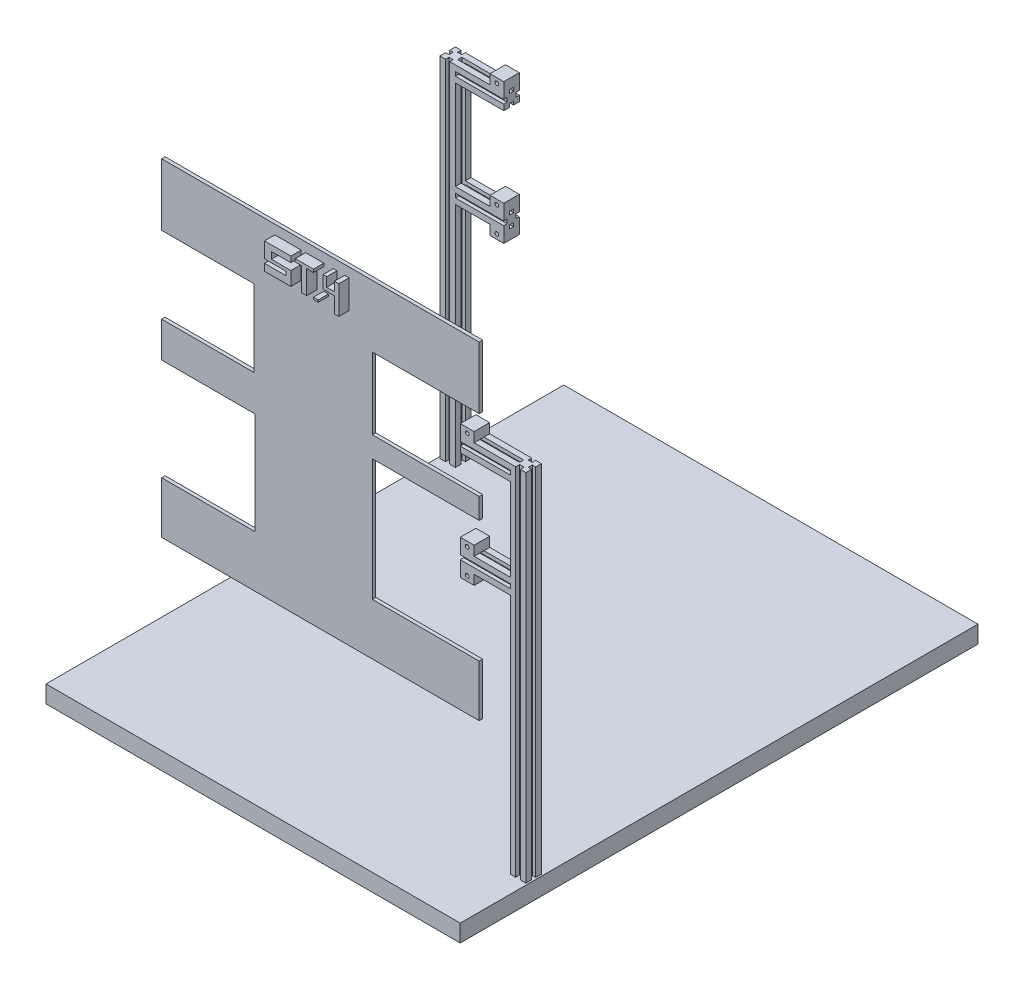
from build123d import *

# Parameters (mm, degrees)
SCHIZZO1_W                    = 1200
SCHIZZO1_H                    = 1500
ESTRUSIONE_ESTRUSIONE1_DEPTH  = 50
ESTRUSIONE_ESTRUSIONE2_DEPTH  = 705
ESTRUSIONE_ESTRUSIONE3_DEPTH  = 140
ESTRUSIONE_ESTRUSIONE4_DEPTH  = 305
ESTRUSIONE_ESTRUSIONE5_DEPTH  = 745
ESTRUSIONE_ESTRUSIONE6_DEPTH  = 145
ESTRUSIONE_ESTRUSIONE7_DEPTH  = 285
SCHIZZO7_W                    = 40
SCHIZZO7_H                    = 45
ESTRUSIONE_ESTRUSIONE8_DEPTH  = 28
SCHIZZO8_R                    = 5.5
TAGLIO_ESTRUSIONE1_DEPTH      = 45
SCHIZZO9_W                    = 40
SCHIZZO9_H                    = 45
ESTRUSIONE_ESTRUSIONE9_DEPTH  = 28
SCHIZZO10_R                   = 5.5
TAGLIO_ESTRUSIONE2_DEPTH      = 45
SCHIZZO11_W                   = 40
SCHIZZO11_H                   = 45
ESTRUSIONE_ESTRUSIONE10_DEPTH = 28
SCHIZZO12_R                   = 5.5
TAGLIO_ESTRUSIONE3_DEPTH      = 45
SCHIZZO13_W                   = 40
SCHIZZO13_H                   = 45
ESTRUSIONE_ESTRUSIONE11_DEPTH = 28
SCHIZZO14_R                   = 5.5
TAGLIO_ESTRUSIONE4_DEPTH      = 45
ESTRUSIONE_ESTRUSIONE12_DEPTH = 140
SCHIZZO16_W                   = 40
SCHIZZO16_H                   = 45
ESTRUSIONE_ESTRUSIONE13_DEPTH = 28
SCHIZZO17_R                   = 5.5
TAGLIO_ESTRUSIONE5_DEPTH      = 45
ESTRUSIONE_ESTRUSIONE14_DEPTH = 145
SCHIZZO19_W                   = 40
SCHIZZO19_H                   = 45
ESTRUSIONE_ESTRUSIONE15_DEPTH = 28
SCHIZZO20_R                   = 5.5
TAGLIO_ESTRUSIONE6_DEPTH      = 45
ESTRUSIONE_ESTRUSIONE16_DEPTH = 10
SCHIZZO22_W                   = 13.690421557
SCHIZZO22_H                   = 5.867323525
ESTRUSIONE_ESTRUSIONE17_DEPTH = 30


with BuildPart() as part:
    # Schizzo1 → Estrusione-Estrusione1 (new body)
    with BuildSketch(Plane(origin=(0, 0, 0), x_dir=(1, 0, 0), z_dir=(0, 1, 0))):
        Rectangle(SCHIZZO1_W, SCHIZZO1_H)
    extrude(amount=ESTRUSIONE_ESTRUSIONE1_DEPTH)

    # Schizzo2 → Estrusione-Estrusione2 (add)
    with BuildSketch(Plane(origin=(0, 50, 0), x_dir=(1, 0, 0), z_dir=(0, 1, 0))):
        Polygon((-578.5, 431.114054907), (-595, 431.114054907), (-595, 414.614054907), (-585, 414.614054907), (-585, 402.614054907), (-595, 402.614054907), (-595, 386.114054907), (-578.5, 386.114054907), (-578.5, 396.114054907), (-566.5, 396.114054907), (-566.5, 386.114054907), (-550, 386.114054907), (-550, 402.614054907), (-560, 402.614054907), (-560, 414.614054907), (-550, 414.614054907), (-550, 431.114054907), (-566.5, 431.114054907), (-566.5, 421.114054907), (-578.5, 421.114054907), align=None)
    extrude(amount=ESTRUSIONE_ESTRUSIONE2_DEPTH)

    # Schizzo3 → Estrusione-Estrusione3 (add)
    with BuildSketch(Plane(origin=(-550, 0, 0), x_dir=(0, 0, -1), z_dir=(1, 0, 0))):
        Polygon((402.614054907, 755), (386.114054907, 755), (386.114054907, 738.5), (396.114054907, 738.5), (396.114054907, 726.5), (386.114054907, 726.5), (386.114054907, 710), (402.614054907, 710), (402.614054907, 720), (402.614054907, 745), align=None)
        Polygon((431.114054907, 755), (414.614054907, 755), (414.614054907, 745), (402.614054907, 745), (402.614054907, 720), (414.614054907, 720), (414.614054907, 710), (431.114054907, 710), (431.114054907, 726.5), (421.114054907, 726.5), (421.114054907, 738.5), (431.114054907, 738.5), align=None)
    extrude(amount=ESTRUSIONE_ESTRUSIONE3_DEPTH)

    # Schizzo4 → Estrusione-Estrusione4 (add)
    with BuildSketch(Plane(origin=(0, 755, 0), x_dir=(1, 0, 0), z_dir=(0, 1, 0))):
        Polygon((-578.5, 431.114054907), (-595, 431.114054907), (-595, 414.614054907), (-585, 414.614054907), (-585, 402.614054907), (-595, 402.614054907), (-595, 386.114054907), (-578.5, 386.114054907), (-578.5, 396.114054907), (-566.5, 396.114054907), (-566.5, 386.114054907), (-550, 386.114054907), (-550, 402.614054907), (-560, 402.614054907), (-560, 414.614054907), (-550, 414.614054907), (-550, 431.114054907), (-566.5, 431.114054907), (-566.5, 421.114054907), (-578.5, 421.114054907), align=None)
    extrude(amount=ESTRUSIONE_ESTRUSIONE4_DEPTH)

    # Schizzo2_3 → Estrusione-Estrusione5 (add)
    with BuildSketch(Plane(origin=(0, 50, 0), x_dir=(1, 0, 0), z_dir=(0, 1, 0))):
        Polygon((566.5, -509.753752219), (550, -509.753752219), (550, -526.253752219), (560, -526.253752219), (560, -538.253752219), (550, -538.253752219), (550, -554.753752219), (565.423232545, -554.753752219), (565.423232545, -543.351967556), (579.052338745, -543.351967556), (579.052338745, -554.753752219), (595, -554.753752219), (595, -538.253752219), (585, -538.253752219), (585, -526.253752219), (595, -526.253752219), (595, -509.753752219), (578.5, -509.753752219), (578.5, -519.753752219), (566.5, -519.753752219), align=None)
    extrude(amount=ESTRUSIONE_ESTRUSIONE5_DEPTH)

    # Schizzo5 → Estrusione-Estrusione6 (add)
    with BuildSketch(Plane.ZY.offset(-550)):
        Polygon((526.253752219, 795), (509.753752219, 795), (509.753752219, 778.631017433), (519.753752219, 778.631017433), (519.753752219, 766.631017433), (509.753752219, 766.631017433), (509.753752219, 750), (526.253752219, 750), (526.253752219, 760), (526.253752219, 785), align=None)
        Polygon((554.753752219, 795), (538.253752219, 795), (538.253752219, 785), (526.253752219, 785), (526.253752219, 760), (538.253752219, 760), (538.253752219, 750), (554.753752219, 750), (554.753752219, 766.631017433), (544.753752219, 766.631017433), (544.753752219, 778.631017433), (554.753752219, 778.631017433), align=None)
    extrude(amount=ESTRUSIONE_ESTRUSIONE6_DEPTH)

    # Schizzo6 → Estrusione-Estrusione7 (add)
    with BuildSketch(Plane(origin=(0, 795, 0), x_dir=(1, 0, 0), z_dir=(0, 1, 0))):
        Polygon((595, -526.253752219), (595, -509.753752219), (578.5, -509.753752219), (578.5, -519.753752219), (566.5, -519.753752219), (566.5, -509.753752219), (550, -509.753752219), (550, -526.253752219), (560, -526.253752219), (560, -538.253752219), (550, -538.253752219), (550, -554.753752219), (565.423232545, -554.753752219), (565.423232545, -543.351967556), (579.052338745, -543.351967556), (579.052338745, -554.753752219), (595, -554.753752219), (595, -538.253752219), (585, -538.253752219), (585, -526.253752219), align=None)
    extrude(amount=ESTRUSIONE_ESTRUSIONE7_DEPTH)

    # Schizzo7 → Estrusione-Estrusione8 (add)
    with BuildSketch(Plane(origin=(0, 755, 0), x_dir=(1, 0, 0), z_dir=(0, 1, 0))):
        with Locations((-430, 408.614054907)):
            Rectangle(SCHIZZO7_W, SCHIZZO7_H)
    extrude(amount=ESTRUSIONE_ESTRUSIONE8_DEPTH)

    # Schizzo8 → Taglio-Estrusione1 (cut)
    with BuildSketch(Plane.XY.offset(-386.114054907)):
        with Locations((-430, 769)):
            Circle(SCHIZZO8_R)
    extrude(amount=-TAGLIO_ESTRUSIONE1_DEPTH, mode=Mode.SUBTRACT)

    # Schizzo9 → Estrusione-Estrusione9 (add)
    with BuildSketch(Plane.XZ.offset(-710)):
        with Locations((-430, -408.614054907)):
            Rectangle(SCHIZZO9_W, SCHIZZO9_H)
    extrude(amount=ESTRUSIONE_ESTRUSIONE9_DEPTH)

    # Schizzo10 → Taglio-Estrusione2 (cut)
    with BuildSketch(Plane.XY.offset(-386.114054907)):
        with Locations((-430, 696)):
            Circle(SCHIZZO10_R)
    extrude(amount=-TAGLIO_ESTRUSIONE2_DEPTH, mode=Mode.SUBTRACT)

    # Schizzo11 → Estrusione-Estrusione10 (add)
    with BuildSketch(Plane(origin=(0, 795, 0), x_dir=(1, 0, 0), z_dir=(0, 1, 0))):
        with Locations((425, -532.253752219)):
            Rectangle(SCHIZZO11_W, SCHIZZO11_H)
    extrude(amount=ESTRUSIONE_ESTRUSIONE10_DEPTH)

    # Schizzo12 → Taglio-Estrusione3 (cut)
    with BuildSketch(Plane.XY.offset(554.753752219)):
        with Locations((425, 809)):
            Circle(SCHIZZO12_R)
    extrude(amount=-TAGLIO_ESTRUSIONE3_DEPTH, mode=Mode.SUBTRACT)

    # Schizzo13 → Estrusione-Estrusione11 (add)
    with BuildSketch(Plane.XZ.offset(-750)):
        with Locations((425, 532.253752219)):
            Rectangle(SCHIZZO13_W, SCHIZZO13_H)
    extrude(amount=ESTRUSIONE_ESTRUSIONE11_DEPTH)

    # Schizzo14 → Taglio-Estrusione4 (cut)
    with BuildSketch(Plane.XY.offset(554.753752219)):
        with Locations((425, 736)):
            Circle(SCHIZZO14_R)
    extrude(amount=-TAGLIO_ESTRUSIONE4_DEPTH, mode=Mode.SUBTRACT)

    # Schizzo15 → Estrusione-Estrusione12 (add)
    with BuildSketch(Plane(origin=(-550, 0, 0), x_dir=(0, 0, -1), z_dir=(1, 0, 0))):
        Polygon((431.114054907, 1060), (414.614054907, 1060), (414.614054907, 1050), (402.614054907, 1050), (402.614054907, 1025), (414.614054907, 1025), (414.614054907, 1015), (431.114054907, 1015), (431.114054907, 1031.5), (421.114054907, 1031.5), (421.114054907, 1043.5), (431.114054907, 1043.5), align=None)
        Polygon((402.614054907, 1060), (386.114054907, 1060), (386.114054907, 1043.5), (396.114054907, 1043.5), (396.114054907, 1031.5), (386.114054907, 1031.5), (386.114054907, 1015), (402.614054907, 1015), (402.614054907, 1025), (402.614054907, 1050), align=None)
    extrude(amount=ESTRUSIONE_ESTRUSIONE12_DEPTH)

    # Schizzo16 → Estrusione-Estrusione13 (add)
    with BuildSketch(Plane(origin=(0, 1060, 0), x_dir=(1, 0, 0), z_dir=(0, 1, 0))):
        with Locations((-430, 408.614054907)):
            Rectangle(SCHIZZO16_W, SCHIZZO16_H)
    extrude(amount=ESTRUSIONE_ESTRUSIONE13_DEPTH)

    # Schizzo17 → Taglio-Estrusione5 (cut)
    with BuildSketch(Plane.XY.offset(-386.114054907)):
        with Locations((-430, 1074)):
            Circle(SCHIZZO17_R)
    extrude(amount=-TAGLIO_ESTRUSIONE5_DEPTH, mode=Mode.SUBTRACT)

    # Schizzo18 → Estrusione-Estrusione14 (add)
    with BuildSketch(Plane.ZY.offset(-550)):
        Polygon((526.253752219, 1070), (526.253752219, 1080), (509.753752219, 1080), (509.753752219, 1063.5), (519.753752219, 1063.5), (519.753752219, 1051.5), (509.753752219, 1051.5), (509.753752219, 1035), (526.253752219, 1035), (526.253752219, 1045), (538.253752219, 1045), (538.253752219, 1070), align=None)
        Polygon((554.753752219, 1063.5), (554.753752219, 1080), (538.253752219, 1080), (538.253752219, 1070), (538.253752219, 1045), (538.253752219, 1035), (554.753752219, 1035), (554.753752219, 1051.5), (544.753752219, 1051.5), (544.753752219, 1063.5), align=None)
    extrude(amount=ESTRUSIONE_ESTRUSIONE14_DEPTH)

    # Schizzo19 → Estrusione-Estrusione15 (add)
    with BuildSketch(Plane(origin=(0, 1080, 0), x_dir=(1, 0, 0), z_dir=(0, 1, 0))):
        with Locations((425, -532.253752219)):
            Rectangle(SCHIZZO19_W, SCHIZZO19_H)
    extrude(amount=ESTRUSIONE_ESTRUSIONE15_DEPTH)

    # Schizzo20 → Taglio-Estrusione6 (cut)
    with BuildSketch(Plane.XY.offset(554.753752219)):
        with Locations((425, 1094)):
            Circle(SCHIZZO20_R)
    extrude(amount=-TAGLIO_ESTRUSIONE6_DEPTH, mode=Mode.SUBTRACT)


with BuildPart() as body_2:
    # Schizzo21 → Estrusione-Estrusione16 (new body)
    with BuildSketch(Plane.XY.offset(554.753752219)):
        Polygon((469.787663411, 1350), (-450.212336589, 1350), (-450.212336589, 1170.21602894), (-182.815929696, 1170.21602894), (-182.815929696, 947.490677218), (-450.212336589, 947.490677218), (-450.212336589, 844.886863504), (-180.313397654, 844.886863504), (-180.313397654, 549.58808257), (-450.212336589, 549.58808257), (-450.212336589, 400), (469.787663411, 400), (469.787663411, 549.58808257), (230.101857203, 549.58808257), (160.030960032, 549.58808257), (160.030960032, 902.445100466), (230.101857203, 902.445100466), (247.619581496, 902.445100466), (469.787663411, 902.445100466), (469.787663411, 962.505869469), (230.101857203, 962.505869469), (160.030960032, 962.505869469), (160.030960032, 1170.21602894), (230.101857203, 1170.21602894), (469.787663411, 1170.21602894), align=None)
    extrude(amount=ESTRUSIONE_ESTRUSIONE16_DEPTH)

    # Schizzo22 → Estrusione-Estrusione17 (add)
    with BuildSketch(Plane.XY.offset(564.753752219)):
        Polygon((-122.172140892, 1322.842913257), (-45.896935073, 1322.842913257), (-45.896935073, 1306.218829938), (-102.61439581, 1306.218829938), (-102.61439581, 1286.661084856), (-45.896935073, 1286.661084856), (-45.896935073, 1246.567707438), (-122.172140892, 1246.567707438), (-122.172140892, 1266.614396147), (-59.58735663, 1266.614396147), (-59.58735663, 1277.860099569), (-122.172140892, 1277.860099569), align=None)
        Polygon((0, 1246.567707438), (-14.604542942, 1246.567707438), (-14.604542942, 1314.530871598), (-33.184400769, 1314.530871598), (-33.184400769, 1322.842913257), (19.621510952, 1322.842913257), (19.621510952, 1314.530871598), (0, 1314.530871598), align=None)
        with Locations((26.466721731, 1249.5013692)):
            Rectangle(SCHIZZO22_W, SCHIZZO22_H)
        Polygon((57.759113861, 1296.439957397), (57.759113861, 1322.842913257), (47.002354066, 1322.842913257), (47.002354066, 1286.661084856), (80.250520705, 1286.661084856), (80.250520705, 1240.700383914), (92.963055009, 1240.700383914), (92.963055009, 1322.842913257), (80.250520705, 1322.842913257), (80.250520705, 1296.439957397), align=None)
    extrude(amount=ESTRUSIONE_ESTRUSIONE17_DEPTH)


solid = Compound([part.part, body_2.part])
